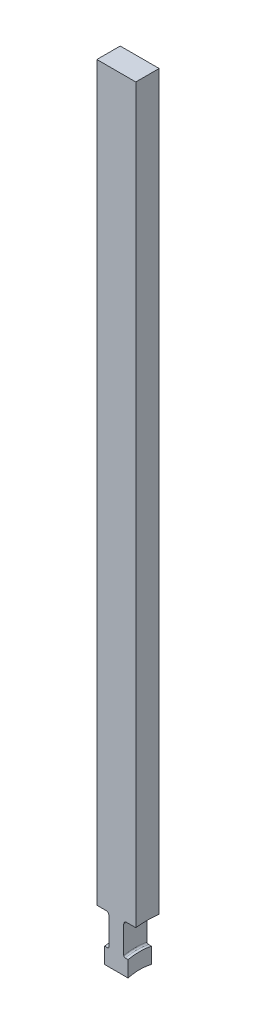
ISO-10303-21;
HEADER;
FILE_DESCRIPTION(('STEP AP214'),'2;1');
FILE_NAME('part.step','',(''),(''),'','','');
FILE_SCHEMA(('AUTOMOTIVE_DESIGN { 1 0 10303 214 1 1 1 1 }'));
ENDSEC;
DATA;
#1=APPLICATION_CONTEXT('core data for automotive mechanical design processes');
#2=APPLICATION_PROTOCOL_DEFINITION('international standard','automotive_design',2000,#1);
#3=PRODUCT_CONTEXT('',#1,'mechanical');
#4=PRODUCT('Part','Part','',(#3));
#5=PRODUCT_RELATED_PRODUCT_CATEGORY('part','',(#4));
#6=PRODUCT_DEFINITION_FORMATION('','',#4);
#7=PRODUCT_DEFINITION_CONTEXT('part definition',#1,'design');
#8=PRODUCT_DEFINITION('design','',#6,#7);
#9=PRODUCT_DEFINITION_SHAPE('','',#8);
#10=(LENGTH_UNIT() NAMED_UNIT(*) SI_UNIT(.MILLI.,.METRE.));
#11=(NAMED_UNIT(*) PLANE_ANGLE_UNIT() SI_UNIT($,.RADIAN.));
#12=(NAMED_UNIT(*) SI_UNIT($,.STERADIAN.) SOLID_ANGLE_UNIT());
#13=UNCERTAINTY_MEASURE_WITH_UNIT(LENGTH_MEASURE(1.E-05),#10,'distance_accuracy_value','');
#14=(GEOMETRIC_REPRESENTATION_CONTEXT(3) GLOBAL_UNCERTAINTY_ASSIGNED_CONTEXT((#13)) GLOBAL_UNIT_ASSIGNED_CONTEXT((#10,
#11,#12)) REPRESENTATION_CONTEXT('',''));
#15=CARTESIAN_POINT('',(0.,0.,0.));
#16=DIRECTION('',(0.,0.,1.));
#17=DIRECTION('',(1.,0.,0.));
#18=AXIS2_PLACEMENT_3D('',#15,#16,#17);
#19=CARTESIAN_POINT('',(5.,212.,2.99999999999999));
#20=DIRECTION('',(0.,0.,-1.));
#21=DIRECTION('',(0.,1.,0.));
#22=AXIS2_PLACEMENT_3D('',#19,#20,#21);
#23=PLANE('',#22);
#24=DIRECTION('',(-1.,0.,0.));
#25=VECTOR('',#24,1.);
#26=CARTESIAN_POINT('',(-8.84822894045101,15.7162336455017,2.99999999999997));
#27=LINE('',#26,#25);
#28=CARTESIAN_POINT('',(-3.,15.7162336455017,2.99999999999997));
#29=VERTEX_POINT('',#28);
#30=CARTESIAN_POINT('',(-2.286,15.7162336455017,2.99999999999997));
#31=VERTEX_POINT('',#30);
#32=EDGE_CURVE('E196',#29,#31,#27,.F.);
#33=ORIENTED_EDGE('',*,*,#32,.F.);
#34=DIRECTION('',(0.,1.,0.));
#35=VECTOR('',#34,1.);
#36=CARTESIAN_POINT('',(-3.,16.,2.99999999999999));
#37=LINE('',#36,#35);
#38=CARTESIAN_POINT('',(-3.,11.6189500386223,2.99999999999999));
#39=VERTEX_POINT('',#38);
#40=EDGE_CURVE('E178',#39,#29,#37,.T.);
#41=ORIENTED_EDGE('',*,*,#40,.F.);
#42=DIRECTION('',(1.,0.,0.));
#43=VECTOR('',#42,1.);
#44=CARTESIAN_POINT('',(-5.,11.6189500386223,2.99999999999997));
#45=LINE('',#44,#43);
#46=CARTESIAN_POINT('',(3.,11.6189500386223,2.99999999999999));
#47=VERTEX_POINT('',#46);
#48=EDGE_CURVE('E176',#39,#47,#45,.T.);
#49=ORIENTED_EDGE('',*,*,#48,.T.);
#50=DIRECTION('',(0.,-1.,0.));
#51=VECTOR('',#50,1.);
#52=CARTESIAN_POINT('',(3.,16.,2.99999999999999));
#53=LINE('',#52,#51);
#54=CARTESIAN_POINT('',(3.,15.7162336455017,2.99999999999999));
#55=VERTEX_POINT('',#54);
#56=EDGE_CURVE('E165',#55,#47,#53,.T.);
#57=ORIENTED_EDGE('',*,*,#56,.F.);
#58=DIRECTION('',(-1.,0.,0.));
#59=VECTOR('',#58,1.);
#60=CARTESIAN_POINT('',(-8.84822894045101,15.7162336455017,2.99999999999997));
#61=LINE('',#60,#59);
#62=CARTESIAN_POINT('',(2.286,15.7162336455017,2.99999999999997));
#63=VERTEX_POINT('',#62);
#64=EDGE_CURVE('E152',#63,#55,#61,.F.);
#65=ORIENTED_EDGE('',*,*,#64,.F.);
#66=CARTESIAN_POINT('',(2.286,15.7162336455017,2.99999999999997));
#67=CARTESIAN_POINT('',(2.26483852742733,15.7162138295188,2.99999999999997));
#68=CARTESIAN_POINT('',(2.24368479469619,15.7180272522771,2.99999999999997));
#69=CARTESIAN_POINT('',(2.20200688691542,15.7251715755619,2.99999999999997));
#70=CARTESIAN_POINT('',(2.18148193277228,15.7304979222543,2.99999999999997));
#71=CARTESIAN_POINT('',(2.14161183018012,15.7445219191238,2.99999999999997));
#72=CARTESIAN_POINT('',(2.12226704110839,15.7532205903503,2.99999999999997));
#73=CARTESIAN_POINT('',(2.08529777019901,15.7737154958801,2.99999999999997));
#74=CARTESIAN_POINT('',(2.06767323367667,15.7855116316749,2.99999999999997));
#75=CARTESIAN_POINT('',(2.03448598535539,15.8119557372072,2.99999999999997));
#76=CARTESIAN_POINT('',(2.01894051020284,15.8266253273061,2.99999999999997));
#77=CARTESIAN_POINT('',(1.99048101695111,15.8583304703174,2.99999999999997));
#78=CARTESIAN_POINT('',(1.97756759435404,15.875366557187,2.99999999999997));
#79=CARTESIAN_POINT('',(1.95451065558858,15.9116241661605,2.99999999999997));
#80=CARTESIAN_POINT('',(1.94441753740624,15.9308777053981,2.99999999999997));
#81=CARTESIAN_POINT('',(1.92755440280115,15.9707855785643,2.99999999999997));
#82=CARTESIAN_POINT('',(1.92078322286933,15.9914394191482,2.99999999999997));
#83=CARTESIAN_POINT('',(1.91218275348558,16.0274736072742,2.99999999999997));
#84=CARTESIAN_POINT('',(1.90949097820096,16.0426541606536,2.99999999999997));
#85=CARTESIAN_POINT('',(1.90589964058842,16.0732042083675,2.99999999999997));
#86=CARTESIAN_POINT('',(1.90499757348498,16.088573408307,2.99999999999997));
#87=CARTESIAN_POINT('',(1.905,16.1039486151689,2.99999999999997));
#88=B_SPLINE_CURVE_WITH_KNOTS('',3,(#66,#67,#68,#69,#70,#71,#72,#73,#74,#75,#76,#77,#78,#79,#80,
#81,#82,#83,#84,#85,#86,#87),.UNSPECIFIED.,.F.,.F.,(4,2,2,2,2,2,2,2,2,2,4),(0.,
0.0633953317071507,0.126708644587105,0.190041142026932,0.253371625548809,0.317198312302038,
0.38103942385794,0.445957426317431,0.510852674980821,0.557004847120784,0.603092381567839),.UNSPECIFIED.);
#89=CARTESIAN_POINT('',(1.905,16.1039486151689,2.99999999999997));
#90=VERTEX_POINT('',#89);
#91=EDGE_CURVE('E11',#63,#90,#88,.T.);
#92=ORIENTED_EDGE('',*,*,#91,.T.);
#93=DIRECTION('',(0.,-1.,0.));
#94=VECTOR('',#93,1.);
#95=CARTESIAN_POINT('',(1.905,212.,2.99999999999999));
#96=LINE('',#95,#94);
#97=CARTESIAN_POINT('',(1.905,23.0435380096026,2.99999999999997));
#98=VERTEX_POINT('',#97);
#99=EDGE_CURVE('E211',#98,#90,#96,.T.);
#100=ORIENTED_EDGE('',*,*,#99,.F.);
#101=CARTESIAN_POINT('',(1.905,23.0435380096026,2.99999999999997));
#102=CARTESIAN_POINT('',(1.90496472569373,23.0870194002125,2.99999999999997));
#103=CARTESIAN_POINT('',(1.90865764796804,23.1304923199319,2.99999999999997));
#104=CARTESIAN_POINT('',(1.92324463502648,23.2161901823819,2.99999999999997));
#105=CARTESIAN_POINT('',(1.93413486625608,23.2584157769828,2.99999999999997));
#106=CARTESIAN_POINT('',(1.96286996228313,23.3404603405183,2.99999999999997));
#107=CARTESIAN_POINT('',(1.9807188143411,23.3802779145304,2.99999999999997));
#108=CARTESIAN_POINT('',(2.02286793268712,23.456326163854,2.99999999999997));
#109=CARTESIAN_POINT('',(2.047166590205,23.492557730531,2.99999999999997));
#110=CARTESIAN_POINT('',(2.10143656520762,23.5602513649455,2.99999999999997));
#111=CARTESIAN_POINT('',(2.13138478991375,23.5917319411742,2.99999999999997));
#112=CARTESIAN_POINT('',(2.19618567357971,23.6491772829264,2.99999999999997));
#113=CARTESIAN_POINT('',(2.23103921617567,23.6751410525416,2.99999999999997));
#114=CARTESIAN_POINT('',(2.30436893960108,23.7205963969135,2.99999999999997));
#115=CARTESIAN_POINT('',(2.34281579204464,23.7401353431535,2.99999999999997));
#116=CARTESIAN_POINT('',(2.42245096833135,23.7724177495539,2.99999999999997));
#117=CARTESIAN_POINT('',(2.46363735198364,23.7851659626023,2.99999999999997));
#118=CARTESIAN_POINT('',(2.53208980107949,23.8001243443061,2.99999999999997));
#119=CARTESIAN_POINT('',(2.55890484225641,23.8044858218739,2.99999999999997));
#120=CARTESIAN_POINT('',(2.61280928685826,23.8103039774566,2.99999999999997));
#121=CARTESIAN_POINT('',(2.63989824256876,23.8117648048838,2.99999999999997));
#122=CARTESIAN_POINT('',(2.667,23.8117617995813,2.99999999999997));
#123=B_SPLINE_CURVE_WITH_KNOTS('',3,(#101,#102,#103,#104,#105,#106,#107,#108,#109,#110,#111,
#112,#113,#114,#115,#116,#117,#118,#119,#120,#121,#122),.UNSPECIFIED.,.F.,.F.,(4,2,2,2,2,2,2,2,
2,2,4),(0.,0.130275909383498,0.260482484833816,0.390763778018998,0.521012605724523,
0.650740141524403,0.780491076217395,0.90926268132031,1.03794403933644,1.11930147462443,
1.20054244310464),.UNSPECIFIED.);
#124=CARTESIAN_POINT('',(2.667,23.8117617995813,2.99999999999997));
#125=VERTEX_POINT('',#124);
#126=EDGE_CURVE('E295',#98,#125,#123,.T.);
#127=ORIENTED_EDGE('',*,*,#126,.T.);
#128=DIRECTION('',(-1.,0.,0.));
#129=VECTOR('',#128,1.);
#130=CARTESIAN_POINT('',(-8.84822894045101,23.8117617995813,2.99999999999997));
#131=LINE('',#130,#129);
#132=CARTESIAN_POINT('',(5.00000000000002,23.8117617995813,2.99999999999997));
#133=VERTEX_POINT('',#132);
#134=EDGE_CURVE('E206',#133,#125,#131,.T.);
#135=ORIENTED_EDGE('',*,*,#134,.F.);
#136=DIRECTION('',(0.,-1.,0.));
#137=VECTOR('',#136,1.);
#138=CARTESIAN_POINT('',(5.,212.,2.99999999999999));
#139=LINE('',#138,#137);
#140=CARTESIAN_POINT('',(5.,212.,2.99999999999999));
#141=VERTEX_POINT('',#140);
#142=EDGE_CURVE('E222',#141,#133,#139,.T.);
#143=ORIENTED_EDGE('',*,*,#142,.F.);
#144=DIRECTION('',(-1.,0.,0.));
#145=VECTOR('',#144,1.);
#146=CARTESIAN_POINT('',(5.,212.,2.99999999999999));
#147=LINE('',#146,#145);
#148=CARTESIAN_POINT('',(-5.,212.,2.99999999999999));
#149=VERTEX_POINT('',#148);
#150=EDGE_CURVE('E237',#141,#149,#147,.T.);
#151=ORIENTED_EDGE('',*,*,#150,.T.);
#152=DIRECTION('',(0.,-1.,0.));
#153=VECTOR('',#152,1.);
#154=CARTESIAN_POINT('',(-5.,212.,2.99999999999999));
#155=LINE('',#154,#153);
#156=CARTESIAN_POINT('',(-5.00000000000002,23.8117617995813,2.99999999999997));
#157=VERTEX_POINT('',#156);
#158=EDGE_CURVE('E231',#149,#157,#155,.T.);
#159=ORIENTED_EDGE('',*,*,#158,.T.);
#160=DIRECTION('',(-1.,0.,0.));
#161=VECTOR('',#160,1.);
#162=CARTESIAN_POINT('',(-8.84822894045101,23.8117617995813,2.99999999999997));
#163=LINE('',#162,#161);
#164=CARTESIAN_POINT('',(-2.667,23.8117617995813,2.99999999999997));
#165=VERTEX_POINT('',#164);
#166=EDGE_CURVE('E202',#165,#157,#163,.T.);
#167=ORIENTED_EDGE('',*,*,#166,.F.);
#168=CARTESIAN_POINT('',(-2.667,23.8117617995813,2.99999999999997));
#169=CARTESIAN_POINT('',(-2.62437695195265,23.8117995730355,2.99999999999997));
#170=CARTESIAN_POINT('',(-2.58176672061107,23.8081596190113,2.99999999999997));
#171=CARTESIAN_POINT('',(-2.49779708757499,23.7938052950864,2.99999999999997));
#172=CARTESIAN_POINT('',(-2.45643647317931,23.7830980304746,2.99999999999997));
#173=CARTESIAN_POINT('',(-2.37608465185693,23.7548833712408,2.99999999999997));
#174=CARTESIAN_POINT('',(-2.33709441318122,23.7373732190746,2.99999999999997));
#175=CARTESIAN_POINT('',(-2.26259793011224,23.6960818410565,2.99999999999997));
#176=CARTESIAN_POINT('',(-2.22709128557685,23.6723013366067,2.99999999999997));
#177=CARTESIAN_POINT('',(-2.16042730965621,23.6190649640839,2.99999999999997));
#178=CARTESIAN_POINT('',(-2.12928506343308,23.5895902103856,2.99999999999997));
#179=CARTESIAN_POINT('',(-2.07234068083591,23.5258591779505,2.99999999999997));
#180=CARTESIAN_POINT('',(-2.04653965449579,23.4916019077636,2.99999999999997));
#181=CARTESIAN_POINT('',(-2.00080741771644,23.4190082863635,2.99999999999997));
#182=CARTESIAN_POINT('',(-1.98092250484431,23.3806428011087,2.99999999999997));
#183=CARTESIAN_POINT('',(-1.94783046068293,23.3011411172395,2.99999999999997));
#184=CARTESIAN_POINT('',(-1.93462021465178,23.2600062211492,2.99999999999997));
#185=CARTESIAN_POINT('',(-1.91830021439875,23.1894697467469,2.99999999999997));
#186=CARTESIAN_POINT('',(-1.91331546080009,23.1604875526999,2.99999999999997));
#187=CARTESIAN_POINT('',(-1.90666562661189,23.1021866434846,2.99999999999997));
#188=CARTESIAN_POINT('',(-1.90499583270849,23.072868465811,2.99999999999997));
#189=CARTESIAN_POINT('',(-1.905,23.0435380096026,2.99999999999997));
#190=B_SPLINE_CURVE_WITH_KNOTS('',3,(#168,#169,#170,#171,#172,#173,#174,#175,#176,#177,#178,
#179,#180,#181,#182,#183,#184,#185,#186,#187,#188,#189),.UNSPECIFIED.,.F.,.F.,(4,2,2,2,2,2,2,2,
2,2,4),(0.,0.127695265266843,0.25526234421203,0.3828811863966,0.510485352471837,
0.638520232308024,0.766581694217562,0.895620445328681,1.02459892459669,1.1126441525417,
1.20056410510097),.UNSPECIFIED.);
#191=CARTESIAN_POINT('',(-1.905,23.0435380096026,2.99999999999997));
#192=VERTEX_POINT('',#191);
#193=EDGE_CURVE('E264',#165,#192,#190,.T.);
#194=ORIENTED_EDGE('',*,*,#193,.T.);
#195=DIRECTION('',(0.,1.,0.));
#196=VECTOR('',#195,1.);
#197=CARTESIAN_POINT('',(-1.905,212.,2.99999999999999));
#198=LINE('',#197,#196);
#199=CARTESIAN_POINT('',(-1.905,16.1039486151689,2.99999999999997));
#200=VERTEX_POINT('',#199);
#201=EDGE_CURVE('E160',#200,#192,#198,.T.);
#202=ORIENTED_EDGE('',*,*,#201,.F.);
#203=CARTESIAN_POINT('',(-1.905,16.1039486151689,2.99999999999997));
#204=CARTESIAN_POINT('',(-1.90498313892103,16.0818581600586,2.99999999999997));
#205=CARTESIAN_POINT('',(-1.90685583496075,16.0597712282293,2.99999999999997));
#206=CARTESIAN_POINT('',(-1.91425675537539,16.0162247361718,2.99999999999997));
#207=CARTESIAN_POINT('',(-1.91978390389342,15.9947649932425,2.99999999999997));
#208=CARTESIAN_POINT('',(-1.93437489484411,15.9530662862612,2.99999999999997));
#209=CARTESIAN_POINT('',(-1.94344097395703,15.9328281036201,2.99999999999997));
#210=CARTESIAN_POINT('',(-1.96486395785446,15.8941821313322,2.99999999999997));
#211=CARTESIAN_POINT('',(-1.9772198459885,15.8757737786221,2.99999999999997));
#212=CARTESIAN_POINT('',(-2.00478592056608,15.8414646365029,2.99999999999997));
#213=CARTESIAN_POINT('',(-2.01997366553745,15.8255458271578,2.99999999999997));
#214=CARTESIAN_POINT('',(-2.05285036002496,15.7965326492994,2.99999999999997));
#215=CARTESIAN_POINT('',(-2.07053969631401,15.783438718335,2.99999999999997));
#216=CARTESIAN_POINT('',(-2.10760244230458,15.7606829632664,2.99999999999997));
#217=CARTESIAN_POINT('',(-2.12694358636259,15.7509685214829,2.99999999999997));
#218=CARTESIAN_POINT('',(-2.16699486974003,15.734991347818,2.99999999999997));
#219=CARTESIAN_POINT('',(-2.18770383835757,15.7287257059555,2.99999999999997));
#220=CARTESIAN_POINT('',(-2.22147725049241,15.7216077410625,2.99999999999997));
#221=CARTESIAN_POINT('',(-2.23430798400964,15.7195936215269,2.99999999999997));
#222=CARTESIAN_POINT('',(-2.26009046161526,15.7169069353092,2.99999999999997));
#223=CARTESIAN_POINT('',(-2.27304200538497,15.7162324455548,2.99999999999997));
#224=CARTESIAN_POINT('',(-2.28599999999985,15.716233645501,2.99999999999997));
#225=B_SPLINE_CURVE_WITH_KNOTS('',3,(#203,#204,#205,#206,#207,#208,#209,#210,#211,#212,#213,
#214,#215,#216,#217,#218,#219,#220,#221,#222,#223,#224),.UNSPECIFIED.,.F.,.F.,(4,2,2,2,2,2,2,2,
2,2,4),(0.,0.0661875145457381,0.132355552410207,0.19856547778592,0.264754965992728,
0.330440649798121,0.396136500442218,0.460758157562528,0.525325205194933,0.56422493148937,
0.603068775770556),.UNSPECIFIED.);
#226=EDGE_CURVE('E309',#200,#31,#225,.T.);
#227=ORIENTED_EDGE('',*,*,#226,.T.);
#228=EDGE_LOOP('',(#33,#41,#49,#57,#65,#92,#100,#127,#135,#143,#151,#159,#167,#194,#202,#227));
#229=FACE_BOUND('',#228,.T.);
#230=ADVANCED_FACE('F37',(#229),#23,.F.);
#231=CARTESIAN_POINT('',(5.,212.,-3.));
#232=DIRECTION('',(0.,0.,1.));
#233=DIRECTION('',(0.,-1.,0.));
#234=AXIS2_PLACEMENT_3D('',#231,#232,#233);
#235=PLANE('',#234);
#236=DIRECTION('',(1.,0.,0.));
#237=VECTOR('',#236,1.);
#238=CARTESIAN_POINT('',(-5.,11.6189500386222,-3.00000000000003));
#239=LINE('',#238,#237);
#240=CARTESIAN_POINT('',(3.,11.6189500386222,-3.00000000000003));
#241=VERTEX_POINT('',#240);
#242=CARTESIAN_POINT('',(-3.,11.6189500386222,-3.00000000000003));
#243=VERTEX_POINT('',#242);
#244=EDGE_CURVE('E214',#241,#243,#239,.F.);
#245=ORIENTED_EDGE('',*,*,#244,.T.);
#246=DIRECTION('',(0.,1.,0.));
#247=VECTOR('',#246,1.);
#248=CARTESIAN_POINT('',(-3.,16.,-3.00000000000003));
#249=LINE('',#248,#247);
#250=CARTESIAN_POINT('',(-3.,15.7162336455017,-3.00000000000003));
#251=VERTEX_POINT('',#250);
#252=EDGE_CURVE('E181',#243,#251,#249,.T.);
#253=ORIENTED_EDGE('',*,*,#252,.T.);
#254=DIRECTION('',(-1.,0.,0.));
#255=VECTOR('',#254,1.);
#256=CARTESIAN_POINT('',(-8.84822894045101,15.7162336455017,-3.00000000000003));
#257=LINE('',#256,#255);
#258=CARTESIAN_POINT('',(-2.286,15.7162336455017,-3.00000000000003));
#259=VERTEX_POINT('',#258);
#260=EDGE_CURVE('E193',#259,#251,#257,.T.);
#261=ORIENTED_EDGE('',*,*,#260,.F.);
#262=CARTESIAN_POINT('',(-2.286,15.7162336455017,-3.00000000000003));
#263=CARTESIAN_POINT('',(-2.26483852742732,15.7162138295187,-3.00000000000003));
#264=CARTESIAN_POINT('',(-2.24368479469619,15.7180272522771,-3.00000000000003));
#265=CARTESIAN_POINT('',(-2.20200688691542,15.7251715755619,-3.00000000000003));
#266=CARTESIAN_POINT('',(-2.18148193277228,15.7304979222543,-3.00000000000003));
#267=CARTESIAN_POINT('',(-2.14161183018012,15.7445219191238,-3.00000000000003));
#268=CARTESIAN_POINT('',(-2.12226704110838,15.7532205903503,-3.00000000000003));
#269=CARTESIAN_POINT('',(-2.08529777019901,15.7737154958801,-3.00000000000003));
#270=CARTESIAN_POINT('',(-2.06767323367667,15.7855116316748,-3.00000000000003));
#271=CARTESIAN_POINT('',(-2.03448598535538,15.8119557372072,-3.00000000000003));
#272=CARTESIAN_POINT('',(-2.01894051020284,15.8266253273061,-3.00000000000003));
#273=CARTESIAN_POINT('',(-1.99048101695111,15.8583304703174,-3.00000000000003));
#274=CARTESIAN_POINT('',(-1.97756759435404,15.875366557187,-3.00000000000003));
#275=CARTESIAN_POINT('',(-1.95451065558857,15.9116241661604,-3.00000000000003));
#276=CARTESIAN_POINT('',(-1.94441753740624,15.9308777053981,-3.00000000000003));
#277=CARTESIAN_POINT('',(-1.92755440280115,15.9707855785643,-3.00000000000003));
#278=CARTESIAN_POINT('',(-1.92078322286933,15.9914394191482,-3.00000000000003));
#279=CARTESIAN_POINT('',(-1.91218275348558,16.0274736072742,-3.00000000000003));
#280=CARTESIAN_POINT('',(-1.90949097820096,16.0426541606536,-3.00000000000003));
#281=CARTESIAN_POINT('',(-1.90589964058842,16.0732042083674,-3.00000000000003));
#282=CARTESIAN_POINT('',(-1.90499757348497,16.088573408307,-3.00000000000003));
#283=CARTESIAN_POINT('',(-1.905,16.1039486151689,-3.00000000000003));
#284=B_SPLINE_CURVE_WITH_KNOTS('',3,(#262,#263,#264,#265,#266,#267,#268,#269,#270,#271,#272,
#273,#274,#275,#276,#277,#278,#279,#280,#281,#282,#283),.UNSPECIFIED.,.F.,.F.,(4,2,2,2,2,2,2,2,
2,2,4),(0.,0.0633953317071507,0.126708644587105,0.190041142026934,0.25337162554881,
0.317198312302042,0.38103942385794,0.445957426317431,0.510852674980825,0.55700484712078,
0.603092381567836),.UNSPECIFIED.);
#285=CARTESIAN_POINT('',(-1.905,16.1039486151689,-3.00000000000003));
#286=VERTEX_POINT('',#285);
#287=EDGE_CURVE('E315',#259,#286,#284,.T.);
#288=ORIENTED_EDGE('',*,*,#287,.T.);
#289=DIRECTION('',(0.,-1.,0.));
#290=VECTOR('',#289,1.);
#291=CARTESIAN_POINT('',(-1.905,212.,-3.));
#292=LINE('',#291,#290);
#293=CARTESIAN_POINT('',(-1.905,23.0435380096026,-3.00000000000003));
#294=VERTEX_POINT('',#293);
#295=EDGE_CURVE('E240',#294,#286,#292,.T.);
#296=ORIENTED_EDGE('',*,*,#295,.F.);
#297=CARTESIAN_POINT('',(-1.905,23.0435380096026,-3.00000000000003));
#298=CARTESIAN_POINT('',(-1.90496472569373,23.0870194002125,-3.00000000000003));
#299=CARTESIAN_POINT('',(-1.90865764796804,23.1304923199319,-3.00000000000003));
#300=CARTESIAN_POINT('',(-1.92324463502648,23.2161901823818,-3.00000000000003));
#301=CARTESIAN_POINT('',(-1.93413486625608,23.2584157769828,-3.00000000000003));
#302=CARTESIAN_POINT('',(-1.96286996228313,23.3404603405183,-3.00000000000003));
#303=CARTESIAN_POINT('',(-1.9807188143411,23.3802779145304,-3.00000000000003));
#304=CARTESIAN_POINT('',(-2.02286793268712,23.456326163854,-3.00000000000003));
#305=CARTESIAN_POINT('',(-2.047166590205,23.492557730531,-3.00000000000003));
#306=CARTESIAN_POINT('',(-2.10143656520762,23.5602513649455,-3.00000000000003));
#307=CARTESIAN_POINT('',(-2.13138478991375,23.5917319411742,-3.00000000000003));
#308=CARTESIAN_POINT('',(-2.19618567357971,23.6491772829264,-3.00000000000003));
#309=CARTESIAN_POINT('',(-2.23103921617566,23.6751410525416,-3.00000000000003));
#310=CARTESIAN_POINT('',(-2.30436893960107,23.7205963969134,-3.00000000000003));
#311=CARTESIAN_POINT('',(-2.34281579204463,23.7401353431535,-3.00000000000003));
#312=CARTESIAN_POINT('',(-2.42245096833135,23.7724177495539,-3.00000000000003));
#313=CARTESIAN_POINT('',(-2.46363735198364,23.7851659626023,-3.00000000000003));
#314=CARTESIAN_POINT('',(-2.53208980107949,23.8001243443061,-3.00000000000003));
#315=CARTESIAN_POINT('',(-2.55890484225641,23.8044858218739,-3.00000000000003));
#316=CARTESIAN_POINT('',(-2.61280928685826,23.8103039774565,-3.00000000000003));
#317=CARTESIAN_POINT('',(-2.63989824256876,23.8117648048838,-3.00000000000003));
#318=CARTESIAN_POINT('',(-2.667,23.8117617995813,-3.00000000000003));
#319=B_SPLINE_CURVE_WITH_KNOTS('',3,(#297,#298,#299,#300,#301,#302,#303,#304,#305,#306,#307,
#308,#309,#310,#311,#312,#313,#314,#315,#316,#317,#318),.UNSPECIFIED.,.F.,.F.,(4,2,2,2,2,2,2,2,
2,2,4),(0.,0.130275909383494,0.260482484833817,0.390763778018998,0.521012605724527,
0.650740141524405,0.780491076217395,0.909262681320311,1.03794403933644,1.11930147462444,
1.20054244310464),.UNSPECIFIED.);
#320=CARTESIAN_POINT('',(-2.667,23.8117617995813,-3.00000000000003));
#321=VERTEX_POINT('',#320);
#322=EDGE_CURVE('E256',#294,#321,#319,.T.);
#323=ORIENTED_EDGE('',*,*,#322,.T.);
#324=DIRECTION('',(-1.,0.,0.));
#325=VECTOR('',#324,1.);
#326=CARTESIAN_POINT('',(-8.84822894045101,23.8117617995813,-3.00000000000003));
#327=LINE('',#326,#325);
#328=CARTESIAN_POINT('',(-5.00000000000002,23.8117617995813,-3.00000000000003));
#329=VERTEX_POINT('',#328);
#330=EDGE_CURVE('E199',#329,#321,#327,.F.);
#331=ORIENTED_EDGE('',*,*,#330,.F.);
#332=DIRECTION('',(0.,1.,0.));
#333=VECTOR('',#332,1.);
#334=CARTESIAN_POINT('',(-5.,212.,-3.));
#335=LINE('',#334,#333);
#336=CARTESIAN_POINT('',(-5.,212.,-3.));
#337=VERTEX_POINT('',#336);
#338=EDGE_CURVE('E223',#329,#337,#335,.T.);
#339=ORIENTED_EDGE('',*,*,#338,.T.);
#340=DIRECTION('',(-1.,0.,0.));
#341=VECTOR('',#340,1.);
#342=CARTESIAN_POINT('',(5.,212.,-3.));
#343=LINE('',#342,#341);
#344=CARTESIAN_POINT('',(5.,212.,-3.));
#345=VERTEX_POINT('',#344);
#346=EDGE_CURVE('E228',#345,#337,#343,.T.);
#347=ORIENTED_EDGE('',*,*,#346,.F.);
#348=DIRECTION('',(0.,1.,0.));
#349=VECTOR('',#348,1.);
#350=CARTESIAN_POINT('',(5.,212.,-3.));
#351=LINE('',#350,#349);
#352=CARTESIAN_POINT('',(5.,23.8117617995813,-3.00000000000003));
#353=VERTEX_POINT('',#352);
#354=EDGE_CURVE('E226',#353,#345,#351,.T.);
#355=ORIENTED_EDGE('',*,*,#354,.F.);
#356=DIRECTION('',(-1.,0.,0.));
#357=VECTOR('',#356,1.);
#358=CARTESIAN_POINT('',(-8.84822894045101,23.8117617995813,-3.00000000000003));
#359=LINE('',#358,#357);
#360=CARTESIAN_POINT('',(2.667,23.8117617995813,-3.00000000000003));
#361=VERTEX_POINT('',#360);
#362=EDGE_CURVE('E204',#361,#353,#359,.F.);
#363=ORIENTED_EDGE('',*,*,#362,.F.);
#364=CARTESIAN_POINT('',(2.667,23.8117617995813,-3.00000000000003));
#365=CARTESIAN_POINT('',(2.62437695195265,23.8117995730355,-3.00000000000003));
#366=CARTESIAN_POINT('',(2.58176672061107,23.8081596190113,-3.00000000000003));
#367=CARTESIAN_POINT('',(2.49779708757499,23.7938052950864,-3.00000000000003));
#368=CARTESIAN_POINT('',(2.45643647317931,23.7830980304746,-3.00000000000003));
#369=CARTESIAN_POINT('',(2.37608465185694,23.7548833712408,-3.00000000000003));
#370=CARTESIAN_POINT('',(2.33709441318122,23.7373732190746,-3.00000000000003));
#371=CARTESIAN_POINT('',(2.26259793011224,23.6960818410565,-3.00000000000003));
#372=CARTESIAN_POINT('',(2.22709128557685,23.6723013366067,-3.00000000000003));
#373=CARTESIAN_POINT('',(2.16042730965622,23.6190649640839,-3.00000000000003));
#374=CARTESIAN_POINT('',(2.12928506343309,23.5895902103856,-3.00000000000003));
#375=CARTESIAN_POINT('',(2.07234068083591,23.5258591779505,-3.00000000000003));
#376=CARTESIAN_POINT('',(2.0465396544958,23.4916019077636,-3.00000000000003));
#377=CARTESIAN_POINT('',(2.00080741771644,23.4190082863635,-3.00000000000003));
#378=CARTESIAN_POINT('',(1.98092250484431,23.3806428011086,-3.00000000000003));
#379=CARTESIAN_POINT('',(1.94783046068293,23.3011411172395,-3.00000000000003));
#380=CARTESIAN_POINT('',(1.93462021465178,23.2600062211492,-3.00000000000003));
#381=CARTESIAN_POINT('',(1.91830021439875,23.1894697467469,-3.00000000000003));
#382=CARTESIAN_POINT('',(1.9133154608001,23.1604875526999,-3.00000000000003));
#383=CARTESIAN_POINT('',(1.90666562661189,23.1021866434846,-3.00000000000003));
#384=CARTESIAN_POINT('',(1.90499583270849,23.072868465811,-3.00000000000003));
#385=CARTESIAN_POINT('',(1.905,23.0435380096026,-3.00000000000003));
#386=B_SPLINE_CURVE_WITH_KNOTS('',3,(#364,#365,#366,#367,#368,#369,#370,#371,#372,#373,#374,
#375,#376,#377,#378,#379,#380,#381,#382,#383,#384,#385),.UNSPECIFIED.,.F.,.F.,(4,2,2,2,2,2,2,2,
2,2,4),(0.,0.127695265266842,0.255262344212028,0.382881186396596,0.510485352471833,
0.638520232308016,0.766581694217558,0.895620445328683,1.02459892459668,1.11264415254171,
1.20056410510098),.UNSPECIFIED.);
#387=CARTESIAN_POINT('',(1.905,23.0435380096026,-3.00000000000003));
#388=VERTEX_POINT('',#387);
#389=EDGE_CURVE('E289',#361,#388,#386,.T.);
#390=ORIENTED_EDGE('',*,*,#389,.T.);
#391=DIRECTION('',(0.,1.,0.));
#392=VECTOR('',#391,1.);
#393=CARTESIAN_POINT('',(1.905,212.,-3.));
#394=LINE('',#393,#392);
#395=CARTESIAN_POINT('',(1.905,16.1039486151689,-3.00000000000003));
#396=VERTEX_POINT('',#395);
#397=EDGE_CURVE('E170',#396,#388,#394,.T.);
#398=ORIENTED_EDGE('',*,*,#397,.F.);
#399=CARTESIAN_POINT('',(1.905,16.1039486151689,-3.00000000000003));
#400=CARTESIAN_POINT('',(1.90498313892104,16.0818581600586,-3.00000000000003));
#401=CARTESIAN_POINT('',(1.90685583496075,16.0597712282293,-3.00000000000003));
#402=CARTESIAN_POINT('',(1.91425675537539,16.0162247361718,-3.00000000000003));
#403=CARTESIAN_POINT('',(1.91978390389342,15.9947649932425,-3.00000000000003));
#404=CARTESIAN_POINT('',(1.93437489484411,15.9530662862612,-3.00000000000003));
#405=CARTESIAN_POINT('',(1.94344097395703,15.9328281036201,-3.00000000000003));
#406=CARTESIAN_POINT('',(1.96486395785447,15.8941821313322,-3.00000000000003));
#407=CARTESIAN_POINT('',(1.9772198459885,15.8757737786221,-3.00000000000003));
#408=CARTESIAN_POINT('',(2.00478592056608,15.8414646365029,-3.00000000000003));
#409=CARTESIAN_POINT('',(2.01997366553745,15.8255458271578,-3.00000000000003));
#410=CARTESIAN_POINT('',(2.05285036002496,15.7965326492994,-3.00000000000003));
#411=CARTESIAN_POINT('',(2.07053969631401,15.7834387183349,-3.00000000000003));
#412=CARTESIAN_POINT('',(2.10760244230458,15.7606829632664,-3.00000000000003));
#413=CARTESIAN_POINT('',(2.12694358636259,15.7509685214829,-3.00000000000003));
#414=CARTESIAN_POINT('',(2.16699486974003,15.734991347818,-3.00000000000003));
#415=CARTESIAN_POINT('',(2.18770383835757,15.7287257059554,-3.00000000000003));
#416=CARTESIAN_POINT('',(2.22147725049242,15.7216077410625,-3.00000000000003));
#417=CARTESIAN_POINT('',(2.23430798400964,15.7195936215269,-3.00000000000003));
#418=CARTESIAN_POINT('',(2.26009046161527,15.7169069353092,-3.00000000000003));
#419=CARTESIAN_POINT('',(2.27304200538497,15.7162324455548,-3.00000000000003));
#420=CARTESIAN_POINT('',(2.28599999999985,15.716233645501,-3.00000000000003));
#421=B_SPLINE_CURVE_WITH_KNOTS('',3,(#399,#400,#401,#402,#403,#404,#405,#406,#407,#408,#409,
#410,#411,#412,#413,#414,#415,#416,#417,#418,#419,#420),.UNSPECIFIED.,.F.,.F.,(4,2,2,2,2,2,2,2,
2,2,4),(0.,0.0661875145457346,0.132355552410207,0.198565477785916,0.264754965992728,
0.330440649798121,0.396136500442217,0.460758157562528,0.525325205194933,0.564224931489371,
0.603068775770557),.UNSPECIFIED.);
#422=CARTESIAN_POINT('',(2.286,15.7162336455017,-3.00000000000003));
#423=VERTEX_POINT('',#422);
#424=EDGE_CURVE('E51',#396,#423,#421,.T.);
#425=ORIENTED_EDGE('',*,*,#424,.T.);
#426=DIRECTION('',(-1.,0.,0.));
#427=VECTOR('',#426,1.);
#428=CARTESIAN_POINT('',(-8.84822894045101,15.7162336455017,-3.00000000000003));
#429=LINE('',#428,#427);
#430=CARTESIAN_POINT('',(3.,15.7162336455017,-3.00000000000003));
#431=VERTEX_POINT('',#430);
#432=EDGE_CURVE('E161',#431,#423,#429,.T.);
#433=ORIENTED_EDGE('',*,*,#432,.F.);
#434=DIRECTION('',(0.,-1.,0.));
#435=VECTOR('',#434,1.);
#436=CARTESIAN_POINT('',(3.,16.,-3.00000000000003));
#437=LINE('',#436,#435);
#438=EDGE_CURVE('E168',#431,#241,#437,.T.);
#439=ORIENTED_EDGE('',*,*,#438,.T.);
#440=EDGE_LOOP('',(#245,#253,#261,#288,#296,#323,#331,#339,#347,#355,#363,#390,#398,#425,#433,#439));
#441=FACE_BOUND('',#440,.T.);
#442=ADVANCED_FACE('F270',(#441),#235,.F.);
#443=CARTESIAN_POINT('',(-5.,0.,0.));
#444=DIRECTION('',(-1.,0.,0.));
#445=DIRECTION('',(0.,0.,1.));
#446=AXIS2_PLACEMENT_3D('',#443,#444,#445);
#447=PLANE('',#446);
#448=ORIENTED_EDGE('',*,*,#338,.F.);
#449=CARTESIAN_POINT('',(-5.00000000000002,0.,0.));
#450=DIRECTION('',(-1.,0.,0.));
#451=DIRECTION('',(0.,0.,1.));
#452=AXIS2_PLACEMENT_3D('',#449,#450,#451);
#453=CIRCLE('',#452,24.);
#454=EDGE_CURVE('E189',#157,#329,#453,.T.);
#455=ORIENTED_EDGE('',*,*,#454,.F.);
#456=ORIENTED_EDGE('',*,*,#158,.F.);
#457=DIRECTION('',(0.,0.,1.));
#458=VECTOR('',#457,1.);
#459=CARTESIAN_POINT('',(-5.,212.,2.99999999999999));
#460=LINE('',#459,#458);
#461=EDGE_CURVE('E218',#337,#149,#460,.T.);
#462=ORIENTED_EDGE('',*,*,#461,.F.);
#463=EDGE_LOOP('',(#448,#455,#456,#462));
#464=FACE_BOUND('',#463,.T.);
#465=ADVANCED_FACE('F378',(#464),#447,.T.);
#466=CARTESIAN_POINT('',(5.,212.,2.99999999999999));
#467=DIRECTION('',(0.,-1.,0.));
#468=DIRECTION('',(0.,0.,-1.));
#469=AXIS2_PLACEMENT_3D('',#466,#467,#468);
#470=PLANE('',#469);
#471=ORIENTED_EDGE('',*,*,#461,.T.);
#472=ORIENTED_EDGE('',*,*,#150,.F.);
#473=DIRECTION('',(0.,0.,1.));
#474=VECTOR('',#473,1.);
#475=CARTESIAN_POINT('',(5.,212.,2.99999999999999));
#476=LINE('',#475,#474);
#477=EDGE_CURVE('E219',#345,#141,#476,.T.);
#478=ORIENTED_EDGE('',*,*,#477,.F.);
#479=ORIENTED_EDGE('',*,*,#346,.T.);
#480=EDGE_LOOP('',(#471,#472,#478,#479));
#481=FACE_BOUND('',#480,.T.);
#482=ADVANCED_FACE('F281',(#481),#470,.F.);
#483=CARTESIAN_POINT('',(5.,0.,0.));
#484=DIRECTION('',(-1.,0.,0.));
#485=DIRECTION('',(0.,0.,1.));
#486=AXIS2_PLACEMENT_3D('',#483,#484,#485);
#487=PLANE('',#486);
#488=CARTESIAN_POINT('',(5.00000000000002,0.,0.));
#489=DIRECTION('',(-1.,0.,0.));
#490=DIRECTION('',(0.,0.,1.));
#491=AXIS2_PLACEMENT_3D('',#488,#489,#490);
#492=CIRCLE('',#491,24.);
#493=EDGE_CURVE('E190',#133,#353,#492,.T.);
#494=ORIENTED_EDGE('',*,*,#493,.T.);
#495=ORIENTED_EDGE('',*,*,#354,.T.);
#496=ORIENTED_EDGE('',*,*,#477,.T.);
#497=ORIENTED_EDGE('',*,*,#142,.T.);
#498=EDGE_LOOP('',(#494,#495,#496,#497));
#499=FACE_BOUND('',#498,.T.);
#500=ADVANCED_FACE('F366',(#499),#487,.F.);
#501=CARTESIAN_POINT('',(-5.,0.,0.));
#502=DIRECTION('',(1.,0.,0.));
#503=DIRECTION('',(0.,0.,-1.));
#504=AXIS2_PLACEMENT_3D('',#501,#502,#503);
#505=CYLINDRICAL_SURFACE('',#504,12.);
#506=ORIENTED_EDGE('',*,*,#48,.F.);
#507=CARTESIAN_POINT('',(-3.,0.,0.));
#508=DIRECTION('',(1.,0.,0.));
#509=DIRECTION('',(0.,1.,0.));
#510=AXIS2_PLACEMENT_3D('',#507,#508,#509);
#511=CIRCLE('',#510,12.);
#512=EDGE_CURVE('E186',#39,#243,#511,.F.);
#513=ORIENTED_EDGE('',*,*,#512,.T.);
#514=ORIENTED_EDGE('',*,*,#244,.F.);
#515=CARTESIAN_POINT('',(3.,0.,0.));
#516=DIRECTION('',(-1.,0.,0.));
#517=DIRECTION('',(0.,-1.,0.));
#518=AXIS2_PLACEMENT_3D('',#515,#516,#517);
#519=CIRCLE('',#518,12.);
#520=EDGE_CURVE('E184',#241,#47,#519,.F.);
#521=ORIENTED_EDGE('',*,*,#520,.T.);
#522=EDGE_LOOP('',(#506,#513,#514,#521));
#523=FACE_BOUND('',#522,.T.);
#524=ADVANCED_FACE('F385',(#523),#505,.F.);
#525=CARTESIAN_POINT('',(-1.905,16.,0.));
#526=DIRECTION('',(-1.,0.,0.));
#527=DIRECTION('',(0.,0.,1.));
#528=AXIS2_PLACEMENT_3D('',#525,#526,#527);
#529=PLANE('',#528);
#530=ORIENTED_EDGE('',*,*,#295,.T.);
#531=CARTESIAN_POINT('',(-1.905,0.,0.));
#532=DIRECTION('',(-1.,0.,0.));
#533=DIRECTION('',(0.,0.,1.));
#534=AXIS2_PLACEMENT_3D('',#531,#532,#533);
#535=CIRCLE('',#534,16.381);
#536=EDGE_CURVE('E328',#286,#200,#535,.F.);
#537=ORIENTED_EDGE('',*,*,#536,.T.);
#538=ORIENTED_EDGE('',*,*,#201,.T.);
#539=CARTESIAN_POINT('',(-1.905,0.,0.));
#540=DIRECTION('',(-1.,0.,0.));
#541=DIRECTION('',(0.,0.,1.));
#542=AXIS2_PLACEMENT_3D('',#539,#540,#541);
#543=CIRCLE('',#542,23.238);
#544=EDGE_CURVE('E246',#192,#294,#543,.T.);
#545=ORIENTED_EDGE('',*,*,#544,.T.);
#546=EDGE_LOOP('',(#530,#537,#538,#545));
#547=FACE_BOUND('',#546,.T.);
#548=ADVANCED_FACE('F383',(#547),#529,.T.);
#549=CARTESIAN_POINT('',(-8.84822894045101,0.,0.));
#550=DIRECTION('',(-1.,0.,0.));
#551=DIRECTION('',(0.,0.,1.));
#552=AXIS2_PLACEMENT_3D('',#549,#550,#551);
#553=CYLINDRICAL_SURFACE('',#552,24.);
#554=ORIENTED_EDGE('',*,*,#330,.T.);
#555=CARTESIAN_POINT('',(-2.667,0.,0.));
#556=DIRECTION('',(-1.,0.,0.));
#557=DIRECTION('',(0.,0.,1.));
#558=AXIS2_PLACEMENT_3D('',#555,#556,#557);
#559=CIRCLE('',#558,24.);
#560=EDGE_CURVE('E249',#321,#165,#559,.F.);
#561=ORIENTED_EDGE('',*,*,#560,.T.);
#562=ORIENTED_EDGE('',*,*,#166,.T.);
#563=ORIENTED_EDGE('',*,*,#454,.T.);
#564=EDGE_LOOP('',(#554,#561,#562,#563));
#565=FACE_BOUND('',#564,.T.);
#566=ADVANCED_FACE('F380',(#565),#553,.F.);
#567=CARTESIAN_POINT('',(-8.84822894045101,0.,0.));
#568=DIRECTION('',(-1.,0.,0.));
#569=DIRECTION('',(0.,0.,1.));
#570=AXIS2_PLACEMENT_3D('',#567,#568,#569);
#571=CYLINDRICAL_SURFACE('',#570,16.);
#572=ORIENTED_EDGE('',*,*,#32,.T.);
#573=CARTESIAN_POINT('',(-2.286,0.,0.));
#574=DIRECTION('',(-1.,0.,0.));
#575=DIRECTION('',(0.,0.,1.));
#576=AXIS2_PLACEMENT_3D('',#573,#574,#575);
#577=CIRCLE('',#576,16.);
#578=EDGE_CURVE('E301',#31,#259,#577,.T.);
#579=ORIENTED_EDGE('',*,*,#578,.T.);
#580=ORIENTED_EDGE('',*,*,#260,.T.);
#581=CARTESIAN_POINT('',(-3.,0.,0.));
#582=DIRECTION('',(1.,0.,0.));
#583=DIRECTION('',(0.,1.,0.));
#584=AXIS2_PLACEMENT_3D('',#581,#582,#583);
#585=CIRCLE('',#584,16.);
#586=EDGE_CURVE('E169',#29,#251,#585,.F.);
#587=ORIENTED_EDGE('',*,*,#586,.F.);
#588=EDGE_LOOP('',(#572,#579,#580,#587));
#589=FACE_BOUND('',#588,.T.);
#590=ADVANCED_FACE('F336',(#589),#571,.T.);
#591=CARTESIAN_POINT('',(1.905,16.,0.));
#592=DIRECTION('',(1.,0.,0.));
#593=DIRECTION('',(0.,0.,-1.));
#594=AXIS2_PLACEMENT_3D('',#591,#592,#593);
#595=PLANE('',#594);
#596=ORIENTED_EDGE('',*,*,#99,.T.);
#597=CARTESIAN_POINT('',(1.905,0.,0.));
#598=DIRECTION('',(1.,0.,0.));
#599=DIRECTION('',(0.,0.,-1.));
#600=AXIS2_PLACEMENT_3D('',#597,#598,#599);
#601=CIRCLE('',#600,16.381);
#602=EDGE_CURVE('E326',#90,#396,#601,.F.);
#603=ORIENTED_EDGE('',*,*,#602,.T.);
#604=ORIENTED_EDGE('',*,*,#397,.T.);
#605=CARTESIAN_POINT('',(1.905,0.,0.));
#606=DIRECTION('',(1.,0.,0.));
#607=DIRECTION('',(0.,0.,-1.));
#608=AXIS2_PLACEMENT_3D('',#605,#606,#607);
#609=CIRCLE('',#608,23.238);
#610=EDGE_CURVE('E254',#388,#98,#609,.T.);
#611=ORIENTED_EDGE('',*,*,#610,.T.);
#612=EDGE_LOOP('',(#596,#603,#604,#611));
#613=FACE_BOUND('',#612,.T.);
#614=ADVANCED_FACE('F356',(#613),#595,.T.);
#615=CARTESIAN_POINT('',(-8.84822894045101,0.,0.));
#616=DIRECTION('',(-1.,0.,0.));
#617=DIRECTION('',(0.,0.,1.));
#618=AXIS2_PLACEMENT_3D('',#615,#616,#617);
#619=CYLINDRICAL_SURFACE('',#618,16.);
#620=ORIENTED_EDGE('',*,*,#432,.T.);
#621=CARTESIAN_POINT('',(2.286,0.,0.));
#622=DIRECTION('',(1.,0.,0.));
#623=DIRECTION('',(0.,0.,-1.));
#624=AXIS2_PLACEMENT_3D('',#621,#622,#623);
#625=CIRCLE('',#624,16.);
#626=EDGE_CURVE('E58',#423,#63,#625,.T.);
#627=ORIENTED_EDGE('',*,*,#626,.T.);
#628=ORIENTED_EDGE('',*,*,#64,.T.);
#629=CARTESIAN_POINT('',(3.,0.,0.));
#630=DIRECTION('',(-1.,0.,0.));
#631=DIRECTION('',(0.,-1.,0.));
#632=AXIS2_PLACEMENT_3D('',#629,#630,#631);
#633=CIRCLE('',#632,16.);
#634=EDGE_CURVE('E155',#431,#55,#633,.F.);
#635=ORIENTED_EDGE('',*,*,#634,.F.);
#636=EDGE_LOOP('',(#620,#627,#628,#635));
#637=FACE_BOUND('',#636,.T.);
#638=ADVANCED_FACE('F154',(#637),#619,.T.);
#639=CARTESIAN_POINT('',(-8.84822894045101,0.,0.));
#640=DIRECTION('',(-1.,0.,0.));
#641=DIRECTION('',(0.,0.,1.));
#642=AXIS2_PLACEMENT_3D('',#639,#640,#641);
#643=CYLINDRICAL_SURFACE('',#642,24.);
#644=ORIENTED_EDGE('',*,*,#134,.T.);
#645=CARTESIAN_POINT('',(2.667,0.,0.));
#646=DIRECTION('',(1.,0.,0.));
#647=DIRECTION('',(0.,0.,-1.));
#648=AXIS2_PLACEMENT_3D('',#645,#646,#647);
#649=CIRCLE('',#648,24.);
#650=EDGE_CURVE('E251',#125,#361,#649,.F.);
#651=ORIENTED_EDGE('',*,*,#650,.T.);
#652=ORIENTED_EDGE('',*,*,#362,.T.);
#653=ORIENTED_EDGE('',*,*,#493,.F.);
#654=EDGE_LOOP('',(#644,#651,#652,#653));
#655=FACE_BOUND('',#654,.T.);
#656=ADVANCED_FACE('F362',(#655),#643,.F.);
#657=CARTESIAN_POINT('',(3.,16.,-3.00000000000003));
#658=DIRECTION('',(-1.,0.,0.));
#659=DIRECTION('',(0.,-1.,0.));
#660=AXIS2_PLACEMENT_3D('',#657,#658,#659);
#661=PLANE('',#660);
#662=ORIENTED_EDGE('',*,*,#438,.F.);
#663=ORIENTED_EDGE('',*,*,#634,.T.);
#664=ORIENTED_EDGE('',*,*,#56,.T.);
#665=ORIENTED_EDGE('',*,*,#520,.F.);
#666=EDGE_LOOP('',(#662,#663,#664,#665));
#667=FACE_BOUND('',#666,.T.);
#668=ADVANCED_FACE('F164',(#667),#661,.F.);
#669=CARTESIAN_POINT('',(-3.,16.,-3.00000000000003));
#670=DIRECTION('',(1.,0.,0.));
#671=DIRECTION('',(0.,1.,0.));
#672=AXIS2_PLACEMENT_3D('',#669,#670,#671);
#673=PLANE('',#672);
#674=ORIENTED_EDGE('',*,*,#40,.T.);
#675=ORIENTED_EDGE('',*,*,#586,.T.);
#676=ORIENTED_EDGE('',*,*,#252,.F.);
#677=ORIENTED_EDGE('',*,*,#512,.F.);
#678=EDGE_LOOP('',(#674,#675,#676,#677));
#679=FACE_BOUND('',#678,.T.);
#680=ADVANCED_FACE('F279',(#679),#673,.F.);
#681=CARTESIAN_POINT('',(-2.667,0.,0.));
#682=DIRECTION('',(-1.,0.,0.));
#683=DIRECTION('',(0.,0.,1.));
#684=AXIS2_PLACEMENT_3D('',#681,#682,#683);
#685=TOROIDAL_SURFACE('',#684,23.238,0.762);
#686=ORIENTED_EDGE('',*,*,#193,.F.);
#687=ORIENTED_EDGE('',*,*,#560,.F.);
#688=ORIENTED_EDGE('',*,*,#322,.F.);
#689=ORIENTED_EDGE('',*,*,#544,.F.);
#690=EDGE_LOOP('',(#686,#687,#688,#689));
#691=FACE_BOUND('',#690,.T.);
#692=ADVANCED_FACE('F273',(#691),#685,.F.);
#693=CARTESIAN_POINT('',(2.667,0.,0.));
#694=DIRECTION('',(1.,0.,0.));
#695=DIRECTION('',(0.,0.,-1.));
#696=AXIS2_PLACEMENT_3D('',#693,#694,#695);
#697=TOROIDAL_SURFACE('',#696,23.238,0.762);
#698=ORIENTED_EDGE('',*,*,#126,.F.);
#699=ORIENTED_EDGE('',*,*,#610,.F.);
#700=ORIENTED_EDGE('',*,*,#389,.F.);
#701=ORIENTED_EDGE('',*,*,#650,.F.);
#702=EDGE_LOOP('',(#698,#699,#700,#701));
#703=FACE_BOUND('',#702,.T.);
#704=ADVANCED_FACE('F278',(#703),#697,.F.);
#705=CARTESIAN_POINT('',(-2.286,0.,0.));
#706=DIRECTION('',(-1.,0.,0.));
#707=DIRECTION('',(0.,0.,1.));
#708=AXIS2_PLACEMENT_3D('',#705,#706,#707);
#709=TOROIDAL_SURFACE('',#708,16.381,0.381);
#710=ORIENTED_EDGE('',*,*,#226,.F.);
#711=ORIENTED_EDGE('',*,*,#536,.F.);
#712=ORIENTED_EDGE('',*,*,#287,.F.);
#713=ORIENTED_EDGE('',*,*,#578,.F.);
#714=EDGE_LOOP('',(#710,#711,#712,#713));
#715=FACE_BOUND('',#714,.T.);
#716=ADVANCED_FACE('F285',(#715),#709,.F.);
#717=CARTESIAN_POINT('',(2.286,0.,0.));
#718=DIRECTION('',(1.,0.,0.));
#719=DIRECTION('',(0.,0.,-1.));
#720=AXIS2_PLACEMENT_3D('',#717,#718,#719);
#721=TOROIDAL_SURFACE('',#720,16.381,0.381);
#722=ORIENTED_EDGE('',*,*,#91,.F.);
#723=ORIENTED_EDGE('',*,*,#626,.F.);
#724=ORIENTED_EDGE('',*,*,#424,.F.);
#725=ORIENTED_EDGE('',*,*,#602,.F.);
#726=EDGE_LOOP('',(#722,#723,#724,#725));
#727=FACE_BOUND('',#726,.T.);
#728=ADVANCED_FACE('F39',(#727),#721,.F.);
#729=CLOSED_SHELL('',(#230,#442,#465,#482,#500,#524,#548,#566,#590,#614,#638,#656,#668,#680,
#692,#704,#716,#728));
#730=MANIFOLD_SOLID_BREP('B2',#729);
#731=ADVANCED_BREP_SHAPE_REPRESENTATION('',(#18,#730),#14);
#732=SHAPE_DEFINITION_REPRESENTATION(#9,#731);
ENDSEC;
END-ISO-10303-21;
